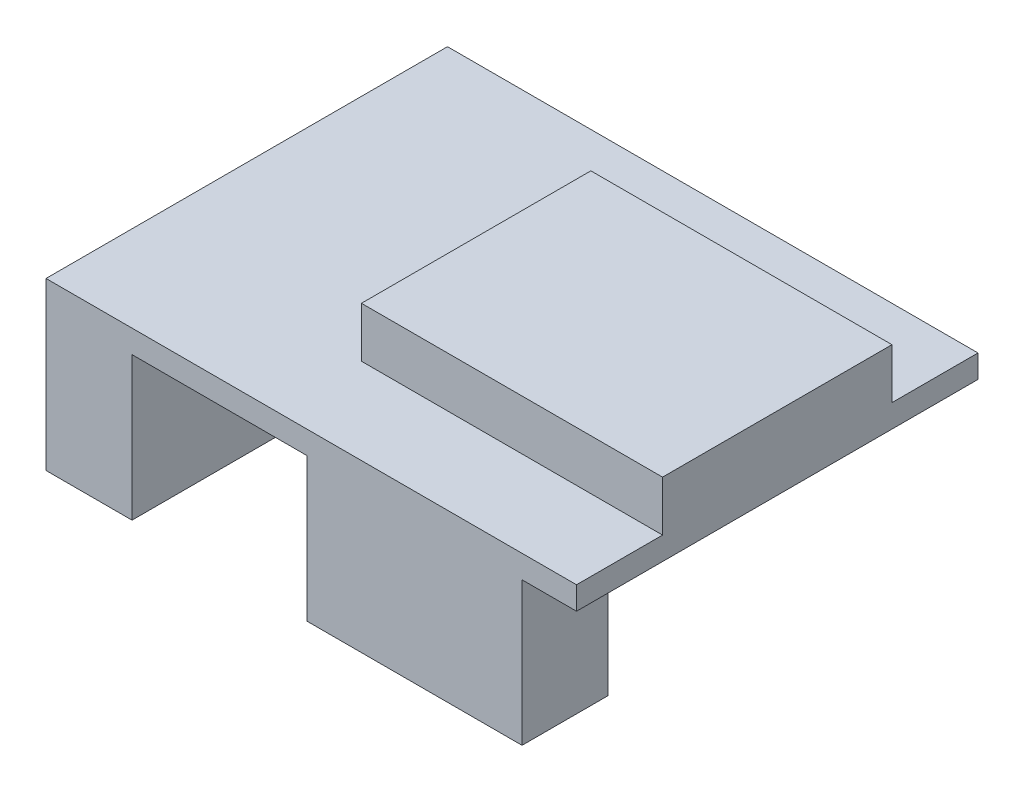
from build123d import *

# Parameters (mm, degrees)
SKETCH_1_W      = 37
SKETCH_1_H      = 28
EXTRUDE_1_DEPTH = 1.6
SKETCH_2_W      = 21
SKETCH_2_H      = 16
EXTRUDE_2_DEPTH = 3.5
EXTRUDE_START   = -1.6
SKETCH_3_W      = 15
SKETCH_3_H      = 6
SKETCH_3_W_2    = 6
SKETCH_3_H_2    = 15
SKETCH_3_H_3    = 7.413167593
EXTRUDE_3_DEPTH = 10


with BuildPart() as part:
    # Sketch 1 → Extrude 1 (new body)
    with BuildSketch(Plane(origin=(0, 0, 0), x_dir=(1, 0, 0), z_dir=(0, 1, 0))):
        Rectangle(SKETCH_1_W, SKETCH_1_H)
    extrude(amount=EXTRUDE_1_DEPTH)

    # Sketch 2 → Extrude 2 (add)
    with BuildSketch(Plane(origin=(0, 1.6, 0), x_dir=(1, 0, 0), z_dir=(0, 1, 0))):
        with Locations((8, 0)):
            Rectangle(SKETCH_2_W, SKETCH_2_H)
    extrude(amount=EXTRUDE_2_DEPTH)

    # Sketch 3 → Extrude 3 (add)
    with BuildSketch(Plane(origin=(0, 1.6, 0), x_dir=(1, 0, 0), z_dir=(0, 1, 0)).offset(EXTRUDE_START)):
        with Locations((7.2, -11)):
            Rectangle(SKETCH_3_W, SKETCH_3_H)
        with Locations((-15.5, -6.5)):
            Rectangle(SKETCH_3_W_2, SKETCH_3_H_2)
        with Locations((-15.5, 10.293416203)):
            Rectangle(SKETCH_3_W_2, SKETCH_3_H_3)
    extrude(amount=-EXTRUDE_3_DEPTH)


solid = part.part
